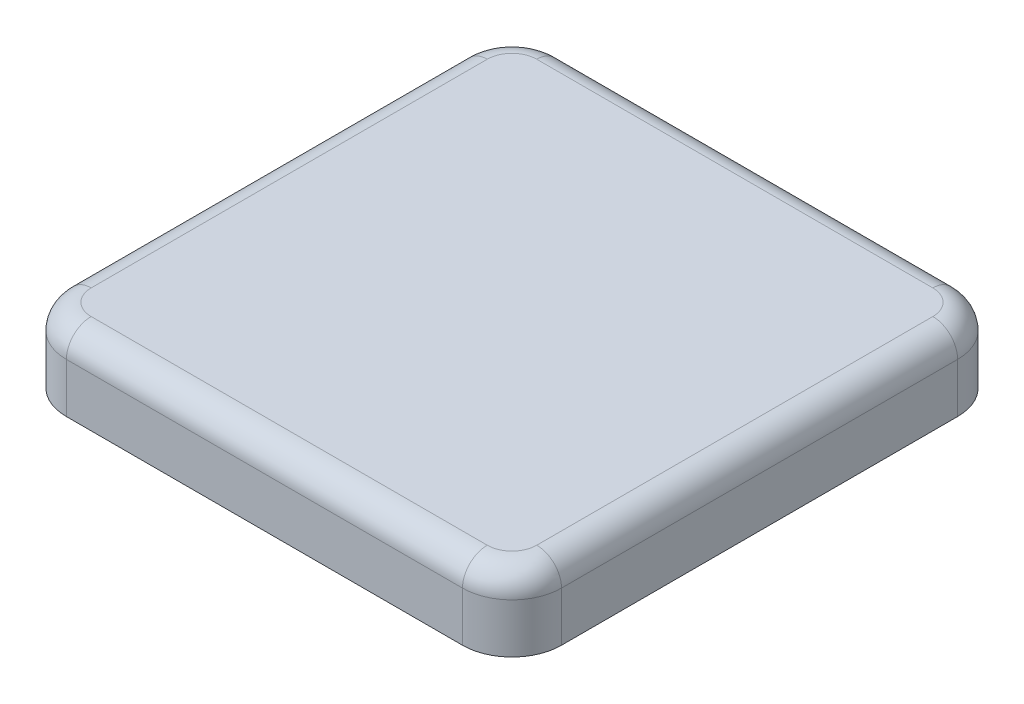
ISO-10303-21;
HEADER;
FILE_DESCRIPTION(('STEP AP214'),'2;1');
FILE_NAME('part.step','',(''),(''),'','','');
FILE_SCHEMA(('AUTOMOTIVE_DESIGN { 1 0 10303 214 1 1 1 1 }'));
ENDSEC;
DATA;
#1=APPLICATION_CONTEXT('core data for automotive mechanical design processes');
#2=APPLICATION_PROTOCOL_DEFINITION('international standard','automotive_design',2000,#1);
#3=PRODUCT_CONTEXT('',#1,'mechanical');
#4=PRODUCT('Part','Part','',(#3));
#5=PRODUCT_RELATED_PRODUCT_CATEGORY('part','',(#4));
#6=PRODUCT_DEFINITION_FORMATION('','',#4);
#7=PRODUCT_DEFINITION_CONTEXT('part definition',#1,'design');
#8=PRODUCT_DEFINITION('design','',#6,#7);
#9=PRODUCT_DEFINITION_SHAPE('','',#8);
#10=(LENGTH_UNIT() NAMED_UNIT(*) SI_UNIT(.MILLI.,.METRE.));
#11=(NAMED_UNIT(*) PLANE_ANGLE_UNIT() SI_UNIT($,.RADIAN.));
#12=(NAMED_UNIT(*) SI_UNIT($,.STERADIAN.) SOLID_ANGLE_UNIT());
#13=UNCERTAINTY_MEASURE_WITH_UNIT(LENGTH_MEASURE(1.E-05),#10,'distance_accuracy_value','');
#14=(GEOMETRIC_REPRESENTATION_CONTEXT(3) GLOBAL_UNCERTAINTY_ASSIGNED_CONTEXT((#13)) GLOBAL_UNIT_ASSIGNED_CONTEXT((#10,
#11,#12)) REPRESENTATION_CONTEXT('',''));
#15=CARTESIAN_POINT('',(0.,0.,0.));
#16=DIRECTION('',(0.,0.,1.));
#17=DIRECTION('',(1.,0.,0.));
#18=AXIS2_PLACEMENT_3D('',#15,#16,#17);
#19=CARTESIAN_POINT('',(-8.,-0.5,8.));
#20=DIRECTION('',(0.,-1.,0.));
#21=DIRECTION('',(0.,0.,-1.));
#22=AXIS2_PLACEMENT_3D('',#19,#20,#21);
#23=PLANE('',#22);
#24=DIRECTION('',(0.,0.,1.));
#25=VECTOR('',#24,1.);
#26=CARTESIAN_POINT('',(-7.8,-0.5,2.5));
#27=LINE('',#26,#25);
#28=CARTESIAN_POINT('',(-7.8,-0.5,-2.5));
#29=VERTEX_POINT('',#28);
#30=CARTESIAN_POINT('',(-7.8,-0.5,2.5));
#31=VERTEX_POINT('',#30);
#32=EDGE_CURVE('E282',#29,#31,#27,.T.);
#33=ORIENTED_EDGE('',*,*,#32,.F.);
#34=DIRECTION('',(1.,0.,0.));
#35=VECTOR('',#34,1.);
#36=CARTESIAN_POINT('',(-8.8,-0.5,-2.5));
#37=LINE('',#36,#35);
#38=CARTESIAN_POINT('',(-8.8,-0.5,-2.5));
#39=VERTEX_POINT('',#38);
#40=EDGE_CURVE('E247',#39,#29,#37,.T.);
#41=ORIENTED_EDGE('',*,*,#40,.F.);
#42=DIRECTION('',(0.,0.,-1.));
#43=VECTOR('',#42,1.);
#44=CARTESIAN_POINT('',(-8.8,-0.5,8.));
#45=LINE('',#44,#43);
#46=CARTESIAN_POINT('',(-8.8,-0.5,-8.));
#47=VERTEX_POINT('',#46);
#48=EDGE_CURVE('E304',#39,#47,#45,.T.);
#49=ORIENTED_EDGE('',*,*,#48,.T.);
#50=CARTESIAN_POINT('',(-8.,-0.5,-8.));
#51=DIRECTION('',(0.,-1.,0.));
#52=DIRECTION('',(0.,0.,-1.));
#53=AXIS2_PLACEMENT_3D('',#50,#51,#52);
#54=CIRCLE('',#53,0.800000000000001);
#55=CARTESIAN_POINT('',(-8.,-0.5,-8.8));
#56=VERTEX_POINT('',#55);
#57=EDGE_CURVE('E309',#47,#56,#54,.T.);
#58=ORIENTED_EDGE('',*,*,#57,.T.);
#59=DIRECTION('',(1.,0.,0.));
#60=VECTOR('',#59,1.);
#61=CARTESIAN_POINT('',(-8.,-0.5,-8.8));
#62=LINE('',#61,#60);
#63=CARTESIAN_POINT('',(8.,-0.5,-8.8));
#64=VERTEX_POINT('',#63);
#65=EDGE_CURVE('E312',#56,#64,#62,.T.);
#66=ORIENTED_EDGE('',*,*,#65,.T.);
#67=CARTESIAN_POINT('',(8.,-0.5,-8.));
#68=DIRECTION('',(0.,-1.,0.));
#69=DIRECTION('',(0.,0.,-1.));
#70=AXIS2_PLACEMENT_3D('',#67,#68,#69);
#71=CIRCLE('',#70,0.800000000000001);
#72=CARTESIAN_POINT('',(8.8,-0.5,-8.));
#73=VERTEX_POINT('',#72);
#74=EDGE_CURVE('E315',#64,#73,#71,.T.);
#75=ORIENTED_EDGE('',*,*,#74,.T.);
#76=DIRECTION('',(0.,0.,1.));
#77=VECTOR('',#76,1.);
#78=CARTESIAN_POINT('',(8.8,-0.5,8.));
#79=LINE('',#78,#77);
#80=CARTESIAN_POINT('',(8.8,-0.5,8.));
#81=VERTEX_POINT('',#80);
#82=EDGE_CURVE('E318',#73,#81,#79,.T.);
#83=ORIENTED_EDGE('',*,*,#82,.T.);
#84=CARTESIAN_POINT('',(8.,-0.5,8.));
#85=DIRECTION('',(0.,-1.,0.));
#86=DIRECTION('',(0.,0.,-1.));
#87=AXIS2_PLACEMENT_3D('',#84,#85,#86);
#88=CIRCLE('',#87,0.799999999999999);
#89=CARTESIAN_POINT('',(8.,-0.5,8.8));
#90=VERTEX_POINT('',#89);
#91=EDGE_CURVE('E321',#81,#90,#88,.T.);
#92=ORIENTED_EDGE('',*,*,#91,.T.);
#93=DIRECTION('',(-1.,0.,0.));
#94=VECTOR('',#93,1.);
#95=CARTESIAN_POINT('',(-8.,-0.5,8.8));
#96=LINE('',#95,#94);
#97=CARTESIAN_POINT('',(-8.,-0.5,8.8));
#98=VERTEX_POINT('',#97);
#99=EDGE_CURVE('E324',#90,#98,#96,.T.);
#100=ORIENTED_EDGE('',*,*,#99,.T.);
#101=CARTESIAN_POINT('',(-8.,-0.5,8.));
#102=DIRECTION('',(0.,-1.,0.));
#103=DIRECTION('',(0.,0.,-1.));
#104=AXIS2_PLACEMENT_3D('',#101,#102,#103);
#105=CIRCLE('',#104,0.8);
#106=CARTESIAN_POINT('',(-8.8,-0.5,8.));
#107=VERTEX_POINT('',#106);
#108=EDGE_CURVE('E301',#98,#107,#105,.T.);
#109=ORIENTED_EDGE('',*,*,#108,.T.);
#110=CARTESIAN_POINT('',(-8.8,-0.5,2.5));
#111=VERTEX_POINT('',#110);
#112=EDGE_CURVE('E306',#107,#111,#45,.T.);
#113=ORIENTED_EDGE('',*,*,#112,.T.);
#114=DIRECTION('',(-1.,0.,0.));
#115=VECTOR('',#114,1.);
#116=CARTESIAN_POINT('',(-8.8,-0.5,2.5));
#117=LINE('',#116,#115);
#118=EDGE_CURVE('E274',#31,#111,#117,.T.);
#119=ORIENTED_EDGE('',*,*,#118,.F.);
#120=EDGE_LOOP('',(#33,#41,#49,#58,#66,#75,#83,#92,#100,#109,#113,#119));
#121=FACE_BOUND('',#120,.T.);
#122=DIRECTION('',(1.,0.,0.));
#123=VECTOR('',#122,1.);
#124=CARTESIAN_POINT('',(-1.2,-0.5,-2.1));
#125=LINE('',#124,#123);
#126=CARTESIAN_POINT('',(-1.2,-0.5,-2.1));
#127=VERTEX_POINT('',#126);
#128=CARTESIAN_POINT('',(1.2,-0.5,-2.1));
#129=VERTEX_POINT('',#128);
#130=EDGE_CURVE('E243',#127,#129,#125,.T.);
#131=ORIENTED_EDGE('',*,*,#130,.F.);
#132=DIRECTION('',(0.,0.,-1.));
#133=VECTOR('',#132,1.);
#134=CARTESIAN_POINT('',(-1.2,-0.5,2.1));
#135=LINE('',#134,#133);
#136=CARTESIAN_POINT('',(-1.2,-0.5,2.1));
#137=VERTEX_POINT('',#136);
#138=EDGE_CURVE('E251',#137,#127,#135,.T.);
#139=ORIENTED_EDGE('',*,*,#138,.F.);
#140=DIRECTION('',(-1.,0.,0.));
#141=VECTOR('',#140,1.);
#142=CARTESIAN_POINT('',(-1.2,-0.5,2.1));
#143=LINE('',#142,#141);
#144=CARTESIAN_POINT('',(1.2,-0.5,2.1));
#145=VERTEX_POINT('',#144);
#146=EDGE_CURVE('E262',#145,#137,#143,.T.);
#147=ORIENTED_EDGE('',*,*,#146,.F.);
#148=DIRECTION('',(0.,0.,1.));
#149=VECTOR('',#148,1.);
#150=CARTESIAN_POINT('',(1.2,-0.5,2.1));
#151=LINE('',#150,#149);
#152=EDGE_CURVE('E260',#129,#145,#151,.T.);
#153=ORIENTED_EDGE('',*,*,#152,.F.);
#154=EDGE_LOOP('',(#131,#139,#147,#153));
#155=FACE_BOUND('',#154,.T.);
#156=ADVANCED_FACE('F37',(#121,#155),#23,.T.);
#157=CARTESIAN_POINT('',(-8.8,-0.5,8.));
#158=DIRECTION('',(-1.,0.,0.));
#159=DIRECTION('',(0.,0.,1.));
#160=AXIS2_PLACEMENT_3D('',#157,#158,#159);
#161=PLANE('',#160);
#162=DIRECTION('',(0.,1.,0.));
#163=VECTOR('',#162,1.);
#164=CARTESIAN_POINT('',(-8.8,-2.5,-2.5));
#165=LINE('',#164,#163);
#166=CARTESIAN_POINT('',(-8.8,-1.5,-2.5));
#167=VERTEX_POINT('',#166);
#168=EDGE_CURVE('E294',#167,#39,#165,.T.);
#169=ORIENTED_EDGE('',*,*,#168,.F.);
#170=DIRECTION('',(0.,0.,-1.));
#171=VECTOR('',#170,1.);
#172=CARTESIAN_POINT('',(-8.8,-1.5,8.));
#173=LINE('',#172,#171);
#174=CARTESIAN_POINT('',(-8.8,-1.5,-8.));
#175=VERTEX_POINT('',#174);
#176=EDGE_CURVE('E329',#167,#175,#173,.T.);
#177=ORIENTED_EDGE('',*,*,#176,.T.);
#178=DIRECTION('',(0.,-1.,0.));
#179=VECTOR('',#178,1.);
#180=CARTESIAN_POINT('',(-8.8,-0.5,-8.));
#181=LINE('',#180,#179);
#182=EDGE_CURVE('E363',#47,#175,#181,.T.);
#183=ORIENTED_EDGE('',*,*,#182,.F.);
#184=ORIENTED_EDGE('',*,*,#48,.F.);
#185=EDGE_LOOP('',(#169,#177,#183,#184));
#186=FACE_BOUND('',#185,.T.);
#187=ADVANCED_FACE('F512',(#186),#161,.F.);
#188=DIRECTION('',(0.,1.,0.));
#189=VECTOR('',#188,1.);
#190=CARTESIAN_POINT('',(-8.8,-2.5,2.5));
#191=LINE('',#190,#189);
#192=CARTESIAN_POINT('',(-8.8,-1.5,2.5));
#193=VERTEX_POINT('',#192);
#194=EDGE_CURVE('E280',#193,#111,#191,.T.);
#195=ORIENTED_EDGE('',*,*,#194,.T.);
#196=ORIENTED_EDGE('',*,*,#112,.F.);
#197=DIRECTION('',(0.,-1.,0.));
#198=VECTOR('',#197,1.);
#199=CARTESIAN_POINT('',(-8.8,-0.5,8.));
#200=LINE('',#199,#198);
#201=CARTESIAN_POINT('',(-8.8,-1.5,8.));
#202=VERTEX_POINT('',#201);
#203=EDGE_CURVE('E327',#107,#202,#200,.T.);
#204=ORIENTED_EDGE('',*,*,#203,.T.);
#205=EDGE_CURVE('E330',#202,#193,#173,.T.);
#206=ORIENTED_EDGE('',*,*,#205,.T.);
#207=EDGE_LOOP('',(#195,#196,#204,#206));
#208=FACE_BOUND('',#207,.T.);
#209=ADVANCED_FACE('F518',(#208),#161,.F.);
#210=CARTESIAN_POINT('',(-8.,1.5,-8.00000000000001));
#211=DIRECTION('',(0.,-1.,0.));
#212=DIRECTION('',(0.,0.,-1.));
#213=AXIS2_PLACEMENT_3D('',#210,#211,#212);
#214=CYLINDRICAL_SURFACE('',#213,2.);
#215=DIRECTION('',(0.,-1.,0.));
#216=VECTOR('',#215,1.);
#217=CARTESIAN_POINT('',(-10.,1.5,-8.00000000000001));
#218=LINE('',#217,#216);
#219=CARTESIAN_POINT('',(-10.,0.5,-8.00000000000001));
#220=VERTEX_POINT('',#219);
#221=CARTESIAN_POINT('',(-10.,-1.5,-8.00000000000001));
#222=VERTEX_POINT('',#221);
#223=EDGE_CURVE('E407',#220,#222,#218,.T.);
#224=ORIENTED_EDGE('',*,*,#223,.F.);
#225=CARTESIAN_POINT('',(-8.,0.5,-8.00000000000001));
#226=DIRECTION('',(0.,1.,0.));
#227=DIRECTION('',(0.,0.,1.));
#228=AXIS2_PLACEMENT_3D('',#225,#226,#227);
#229=CIRCLE('',#228,2.);
#230=CARTESIAN_POINT('',(-8.,0.5,-10.));
#231=VERTEX_POINT('',#230);
#232=EDGE_CURVE('E431',#220,#231,#229,.F.);
#233=ORIENTED_EDGE('',*,*,#232,.T.);
#234=DIRECTION('',(0.,-1.,0.));
#235=VECTOR('',#234,1.);
#236=CARTESIAN_POINT('',(-8.,1.5,-10.));
#237=LINE('',#236,#235);
#238=CARTESIAN_POINT('',(-8.,-1.5,-10.));
#239=VERTEX_POINT('',#238);
#240=EDGE_CURVE('E393',#231,#239,#237,.T.);
#241=ORIENTED_EDGE('',*,*,#240,.T.);
#242=CARTESIAN_POINT('',(-8.,-1.5,-8.00000000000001));
#243=DIRECTION('',(0.,1.,0.));
#244=DIRECTION('',(0.,0.,1.));
#245=AXIS2_PLACEMENT_3D('',#242,#243,#244);
#246=CIRCLE('',#245,2.);
#247=EDGE_CURVE('E368',#239,#222,#246,.T.);
#248=ORIENTED_EDGE('',*,*,#247,.T.);
#249=EDGE_LOOP('',(#224,#233,#241,#248));
#250=FACE_BOUND('',#249,.T.);
#251=ADVANCED_FACE('F591',(#250),#214,.T.);
#252=CARTESIAN_POINT('',(-10.,1.5,8.));
#253=DIRECTION('',(1.,0.,0.));
#254=DIRECTION('',(0.,0.,-1.));
#255=AXIS2_PLACEMENT_3D('',#252,#253,#254);
#256=PLANE('',#255);
#257=DIRECTION('',(0.,-1.,0.));
#258=VECTOR('',#257,1.);
#259=CARTESIAN_POINT('',(-10.,1.5,8.));
#260=LINE('',#259,#258);
#261=CARTESIAN_POINT('',(-10.,0.5,8.));
#262=VERTEX_POINT('',#261);
#263=CARTESIAN_POINT('',(-10.,-1.5,8.));
#264=VERTEX_POINT('',#263);
#265=EDGE_CURVE('E405',#262,#264,#260,.T.);
#266=ORIENTED_EDGE('',*,*,#265,.F.);
#267=DIRECTION('',(0.,0.,1.));
#268=VECTOR('',#267,1.);
#269=CARTESIAN_POINT('',(-10.,0.5,-8.00000000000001));
#270=LINE('',#269,#268);
#271=EDGE_CURVE('E429',#262,#220,#270,.F.);
#272=ORIENTED_EDGE('',*,*,#271,.T.);
#273=ORIENTED_EDGE('',*,*,#223,.T.);
#274=DIRECTION('',(0.,0.,1.));
#275=VECTOR('',#274,1.);
#276=CARTESIAN_POINT('',(-10.,-1.5,8.));
#277=LINE('',#276,#275);
#278=EDGE_CURVE('E371',#222,#264,#277,.T.);
#279=ORIENTED_EDGE('',*,*,#278,.T.);
#280=EDGE_LOOP('',(#266,#272,#273,#279));
#281=FACE_BOUND('',#280,.T.);
#282=ADVANCED_FACE('F587',(#281),#256,.F.);
#283=CARTESIAN_POINT('',(-8.,1.5,8.));
#284=DIRECTION('',(0.,-1.,0.));
#285=DIRECTION('',(0.,0.,-1.));
#286=AXIS2_PLACEMENT_3D('',#283,#284,#285);
#287=CYLINDRICAL_SURFACE('',#286,2.);
#288=DIRECTION('',(0.,-1.,0.));
#289=VECTOR('',#288,1.);
#290=CARTESIAN_POINT('',(-8.,1.5,10.));
#291=LINE('',#290,#289);
#292=CARTESIAN_POINT('',(-8.,0.5,10.));
#293=VERTEX_POINT('',#292);
#294=CARTESIAN_POINT('',(-8.,-1.5,10.));
#295=VERTEX_POINT('',#294);
#296=EDGE_CURVE('E403',#293,#295,#291,.T.);
#297=ORIENTED_EDGE('',*,*,#296,.F.);
#298=CARTESIAN_POINT('',(-8.,0.5,8.));
#299=DIRECTION('',(0.,1.,0.));
#300=DIRECTION('',(0.,0.,1.));
#301=AXIS2_PLACEMENT_3D('',#298,#299,#300);
#302=CIRCLE('',#301,2.);
#303=EDGE_CURVE('E426',#293,#262,#302,.F.);
#304=ORIENTED_EDGE('',*,*,#303,.T.);
#305=ORIENTED_EDGE('',*,*,#265,.T.);
#306=CARTESIAN_POINT('',(-8.,-1.5,8.));
#307=DIRECTION('',(0.,1.,0.));
#308=DIRECTION('',(0.,0.,1.));
#309=AXIS2_PLACEMENT_3D('',#306,#307,#308);
#310=CIRCLE('',#309,2.);
#311=EDGE_CURVE('E375',#264,#295,#310,.T.);
#312=ORIENTED_EDGE('',*,*,#311,.T.);
#313=EDGE_LOOP('',(#297,#304,#305,#312));
#314=FACE_BOUND('',#313,.T.);
#315=ADVANCED_FACE('F583',(#314),#287,.T.);
#316=CARTESIAN_POINT('',(-8.,1.5,10.));
#317=DIRECTION('',(0.,0.,-1.));
#318=DIRECTION('',(-1.,0.,0.));
#319=AXIS2_PLACEMENT_3D('',#316,#317,#318);
#320=PLANE('',#319);
#321=DIRECTION('',(0.,-1.,0.));
#322=VECTOR('',#321,1.);
#323=CARTESIAN_POINT('',(8.,1.5,10.));
#324=LINE('',#323,#322);
#325=CARTESIAN_POINT('',(8.,0.5,10.));
#326=VERTEX_POINT('',#325);
#327=CARTESIAN_POINT('',(8.,-1.5,10.));
#328=VERTEX_POINT('',#327);
#329=EDGE_CURVE('E401',#326,#328,#324,.T.);
#330=ORIENTED_EDGE('',*,*,#329,.F.);
#331=DIRECTION('',(1.,0.,0.));
#332=VECTOR('',#331,1.);
#333=CARTESIAN_POINT('',(-8.,0.5,10.));
#334=LINE('',#333,#332);
#335=EDGE_CURVE('E441',#326,#293,#334,.F.);
#336=ORIENTED_EDGE('',*,*,#335,.T.);
#337=ORIENTED_EDGE('',*,*,#296,.T.);
#338=DIRECTION('',(1.,0.,0.));
#339=VECTOR('',#338,1.);
#340=CARTESIAN_POINT('',(-8.,-1.5,10.));
#341=LINE('',#340,#339);
#342=EDGE_CURVE('E378',#295,#328,#341,.T.);
#343=ORIENTED_EDGE('',*,*,#342,.T.);
#344=EDGE_LOOP('',(#330,#336,#337,#343));
#345=FACE_BOUND('',#344,.T.);
#346=ADVANCED_FACE('F579',(#345),#320,.F.);
#347=CARTESIAN_POINT('',(8.,1.5,8.));
#348=DIRECTION('',(0.,-1.,0.));
#349=DIRECTION('',(0.,0.,-1.));
#350=AXIS2_PLACEMENT_3D('',#347,#348,#349);
#351=CYLINDRICAL_SURFACE('',#350,2.);
#352=DIRECTION('',(0.,-1.,0.));
#353=VECTOR('',#352,1.);
#354=CARTESIAN_POINT('',(10.,1.5,8.));
#355=LINE('',#354,#353);
#356=CARTESIAN_POINT('',(10.,0.5,8.));
#357=VERTEX_POINT('',#356);
#358=CARTESIAN_POINT('',(10.,-1.5,8.));
#359=VERTEX_POINT('',#358);
#360=EDGE_CURVE('E399',#357,#359,#355,.T.);
#361=ORIENTED_EDGE('',*,*,#360,.F.);
#362=CARTESIAN_POINT('',(8.,0.5,8.));
#363=DIRECTION('',(0.,1.,0.));
#364=DIRECTION('',(0.,0.,1.));
#365=AXIS2_PLACEMENT_3D('',#362,#363,#364);
#366=CIRCLE('',#365,2.);
#367=EDGE_CURVE('E439',#357,#326,#366,.F.);
#368=ORIENTED_EDGE('',*,*,#367,.T.);
#369=ORIENTED_EDGE('',*,*,#329,.T.);
#370=CARTESIAN_POINT('',(8.,-1.5,8.));
#371=DIRECTION('',(0.,1.,0.));
#372=DIRECTION('',(0.,0.,1.));
#373=AXIS2_PLACEMENT_3D('',#370,#371,#372);
#374=CIRCLE('',#373,2.);
#375=EDGE_CURVE('E381',#328,#359,#374,.T.);
#376=ORIENTED_EDGE('',*,*,#375,.T.);
#377=EDGE_LOOP('',(#361,#368,#369,#376));
#378=FACE_BOUND('',#377,.T.);
#379=ADVANCED_FACE('F575',(#378),#351,.T.);
#380=CARTESIAN_POINT('',(10.,1.5,8.));
#381=DIRECTION('',(-1.,0.,0.));
#382=DIRECTION('',(0.,0.,1.));
#383=AXIS2_PLACEMENT_3D('',#380,#381,#382);
#384=PLANE('',#383);
#385=DIRECTION('',(0.,-1.,0.));
#386=VECTOR('',#385,1.);
#387=CARTESIAN_POINT('',(10.,1.5,-8.00000000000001));
#388=LINE('',#387,#386);
#389=CARTESIAN_POINT('',(10.,0.5,-8.00000000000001));
#390=VERTEX_POINT('',#389);
#391=CARTESIAN_POINT('',(10.,-1.5,-8.00000000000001));
#392=VERTEX_POINT('',#391);
#393=EDGE_CURVE('E397',#390,#392,#388,.T.);
#394=ORIENTED_EDGE('',*,*,#393,.F.);
#395=DIRECTION('',(0.,0.,-1.));
#396=VECTOR('',#395,1.);
#397=CARTESIAN_POINT('',(10.,0.5,8.));
#398=LINE('',#397,#396);
#399=EDGE_CURVE('E437',#390,#357,#398,.F.);
#400=ORIENTED_EDGE('',*,*,#399,.T.);
#401=ORIENTED_EDGE('',*,*,#360,.T.);
#402=DIRECTION('',(0.,0.,-1.));
#403=VECTOR('',#402,1.);
#404=CARTESIAN_POINT('',(10.,-1.5,8.));
#405=LINE('',#404,#403);
#406=EDGE_CURVE('E384',#359,#392,#405,.T.);
#407=ORIENTED_EDGE('',*,*,#406,.T.);
#408=EDGE_LOOP('',(#394,#400,#401,#407));
#409=FACE_BOUND('',#408,.T.);
#410=ADVANCED_FACE('F571',(#409),#384,.F.);
#411=CARTESIAN_POINT('',(8.,1.5,-8.00000000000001));
#412=DIRECTION('',(0.,-1.,0.));
#413=DIRECTION('',(0.,0.,-1.));
#414=AXIS2_PLACEMENT_3D('',#411,#412,#413);
#415=CYLINDRICAL_SURFACE('',#414,2.);
#416=DIRECTION('',(0.,-1.,0.));
#417=VECTOR('',#416,1.);
#418=CARTESIAN_POINT('',(8.,1.5,-10.));
#419=LINE('',#418,#417);
#420=CARTESIAN_POINT('',(8.,0.5,-10.));
#421=VERTEX_POINT('',#420);
#422=CARTESIAN_POINT('',(8.,-1.5,-10.));
#423=VERTEX_POINT('',#422);
#424=EDGE_CURVE('E395',#421,#423,#419,.T.);
#425=ORIENTED_EDGE('',*,*,#424,.F.);
#426=CARTESIAN_POINT('',(8.,0.5,-8.00000000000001));
#427=DIRECTION('',(0.,1.,0.));
#428=DIRECTION('',(0.,0.,1.));
#429=AXIS2_PLACEMENT_3D('',#426,#427,#428);
#430=CIRCLE('',#429,2.);
#431=EDGE_CURVE('E435',#421,#390,#430,.F.);
#432=ORIENTED_EDGE('',*,*,#431,.T.);
#433=ORIENTED_EDGE('',*,*,#393,.T.);
#434=CARTESIAN_POINT('',(8.,-1.5,-8.00000000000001));
#435=DIRECTION('',(0.,1.,0.));
#436=DIRECTION('',(0.,0.,1.));
#437=AXIS2_PLACEMENT_3D('',#434,#435,#436);
#438=CIRCLE('',#437,2.);
#439=EDGE_CURVE('E387',#392,#423,#438,.T.);
#440=ORIENTED_EDGE('',*,*,#439,.T.);
#441=EDGE_LOOP('',(#425,#432,#433,#440));
#442=FACE_BOUND('',#441,.T.);
#443=ADVANCED_FACE('F567',(#442),#415,.T.);
#444=CARTESIAN_POINT('',(-8.,1.5,-10.));
#445=DIRECTION('',(0.,0.,1.));
#446=DIRECTION('',(1.,0.,0.));
#447=AXIS2_PLACEMENT_3D('',#444,#445,#446);
#448=PLANE('',#447);
#449=ORIENTED_EDGE('',*,*,#240,.F.);
#450=DIRECTION('',(-1.,0.,0.));
#451=VECTOR('',#450,1.);
#452=CARTESIAN_POINT('',(8.,0.5,-10.));
#453=LINE('',#452,#451);
#454=EDGE_CURVE('E433',#231,#421,#453,.F.);
#455=ORIENTED_EDGE('',*,*,#454,.T.);
#456=ORIENTED_EDGE('',*,*,#424,.T.);
#457=DIRECTION('',(-1.,0.,0.));
#458=VECTOR('',#457,1.);
#459=CARTESIAN_POINT('',(-8.,-1.5,-10.));
#460=LINE('',#459,#458);
#461=EDGE_CURVE('E390',#423,#239,#460,.T.);
#462=ORIENTED_EDGE('',*,*,#461,.T.);
#463=EDGE_LOOP('',(#449,#455,#456,#462));
#464=FACE_BOUND('',#463,.T.);
#465=ADVANCED_FACE('F559',(#464),#448,.F.);
#466=CARTESIAN_POINT('',(-8.,1.5,-8.00000000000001));
#467=DIRECTION('',(0.,1.,0.));
#468=DIRECTION('',(0.,0.,1.));
#469=AXIS2_PLACEMENT_3D('',#466,#467,#468);
#470=PLANE('',#469);
#471=DIRECTION('',(0.,0.,1.));
#472=VECTOR('',#471,1.);
#473=CARTESIAN_POINT('',(-9.,1.5,8.));
#474=LINE('',#473,#472);
#475=CARTESIAN_POINT('',(-9.,1.5,-8.00000000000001));
#476=VERTEX_POINT('',#475);
#477=CARTESIAN_POINT('',(-9.,1.5,8.));
#478=VERTEX_POINT('',#477);
#479=EDGE_CURVE('E421',#476,#478,#474,.T.);
#480=ORIENTED_EDGE('',*,*,#479,.T.);
#481=CARTESIAN_POINT('',(-8.,1.5,8.));
#482=DIRECTION('',(0.,1.,0.));
#483=DIRECTION('',(0.,0.,1.));
#484=AXIS2_PLACEMENT_3D('',#481,#482,#483);
#485=CIRCLE('',#484,1.);
#486=CARTESIAN_POINT('',(-8.,1.5,9.));
#487=VERTEX_POINT('',#486);
#488=EDGE_CURVE('E423',#478,#487,#485,.T.);
#489=ORIENTED_EDGE('',*,*,#488,.T.);
#490=DIRECTION('',(1.,0.,0.));
#491=VECTOR('',#490,1.);
#492=CARTESIAN_POINT('',(8.,1.5,9.));
#493=LINE('',#492,#491);
#494=CARTESIAN_POINT('',(8.,1.5,9.));
#495=VERTEX_POINT('',#494);
#496=EDGE_CURVE('E409',#487,#495,#493,.T.);
#497=ORIENTED_EDGE('',*,*,#496,.T.);
#498=CARTESIAN_POINT('',(8.,1.5,8.));
#499=DIRECTION('',(0.,1.,0.));
#500=DIRECTION('',(0.,0.,1.));
#501=AXIS2_PLACEMENT_3D('',#498,#499,#500);
#502=CIRCLE('',#501,0.999999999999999);
#503=CARTESIAN_POINT('',(9.,1.5,8.));
#504=VERTEX_POINT('',#503);
#505=EDGE_CURVE('E411',#495,#504,#502,.T.);
#506=ORIENTED_EDGE('',*,*,#505,.T.);
#507=DIRECTION('',(0.,0.,-1.));
#508=VECTOR('',#507,1.);
#509=CARTESIAN_POINT('',(9.,1.5,-8.00000000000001));
#510=LINE('',#509,#508);
#511=CARTESIAN_POINT('',(9.,1.5,-8.00000000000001));
#512=VERTEX_POINT('',#511);
#513=EDGE_CURVE('E413',#504,#512,#510,.T.);
#514=ORIENTED_EDGE('',*,*,#513,.T.);
#515=CARTESIAN_POINT('',(8.,1.5,-8.00000000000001));
#516=DIRECTION('',(0.,1.,0.));
#517=DIRECTION('',(0.,0.,1.));
#518=AXIS2_PLACEMENT_3D('',#515,#516,#517);
#519=CIRCLE('',#518,0.999999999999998);
#520=CARTESIAN_POINT('',(8.,1.5,-9.00000000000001));
#521=VERTEX_POINT('',#520);
#522=EDGE_CURVE('E415',#512,#521,#519,.T.);
#523=ORIENTED_EDGE('',*,*,#522,.T.);
#524=DIRECTION('',(-1.,0.,0.));
#525=VECTOR('',#524,1.);
#526=CARTESIAN_POINT('',(-8.,1.5,-9.00000000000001));
#527=LINE('',#526,#525);
#528=CARTESIAN_POINT('',(-8.,1.5,-9.00000000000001));
#529=VERTEX_POINT('',#528);
#530=EDGE_CURVE('E417',#521,#529,#527,.T.);
#531=ORIENTED_EDGE('',*,*,#530,.T.);
#532=CARTESIAN_POINT('',(-8.,1.5,-8.00000000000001));
#533=DIRECTION('',(0.,1.,0.));
#534=DIRECTION('',(0.,0.,1.));
#535=AXIS2_PLACEMENT_3D('',#532,#533,#534);
#536=CIRCLE('',#535,0.999999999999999);
#537=EDGE_CURVE('E419',#529,#476,#536,.T.);
#538=ORIENTED_EDGE('',*,*,#537,.T.);
#539=EDGE_LOOP('',(#480,#489,#497,#506,#514,#523,#531,#538));
#540=FACE_BOUND('',#539,.T.);
#541=ADVANCED_FACE('F555',(#540),#470,.T.);
#542=CARTESIAN_POINT('',(-8.,-1.5,-8.00000000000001));
#543=DIRECTION('',(0.,1.,0.));
#544=DIRECTION('',(0.,0.,1.));
#545=AXIS2_PLACEMENT_3D('',#542,#543,#544);
#546=PLANE('',#545);
#547=ORIENTED_EDGE('',*,*,#205,.F.);
#548=CARTESIAN_POINT('',(-8.,-1.5,8.));
#549=DIRECTION('',(0.,-1.,0.));
#550=DIRECTION('',(0.,0.,-1.));
#551=AXIS2_PLACEMENT_3D('',#548,#549,#550);
#552=CIRCLE('',#551,0.8);
#553=CARTESIAN_POINT('',(-8.,-1.5,8.8));
#554=VERTEX_POINT('',#553);
#555=EDGE_CURVE('E300',#554,#202,#552,.T.);
#556=ORIENTED_EDGE('',*,*,#555,.F.);
#557=DIRECTION('',(-1.,0.,0.));
#558=VECTOR('',#557,1.);
#559=CARTESIAN_POINT('',(-8.,-1.5,8.8));
#560=LINE('',#559,#558);
#561=CARTESIAN_POINT('',(8.,-1.5,8.8));
#562=VERTEX_POINT('',#561);
#563=EDGE_CURVE('E305',#562,#554,#560,.T.);
#564=ORIENTED_EDGE('',*,*,#563,.F.);
#565=CARTESIAN_POINT('',(8.,-1.5,8.));
#566=DIRECTION('',(0.,-1.,0.));
#567=DIRECTION('',(0.,0.,-1.));
#568=AXIS2_PLACEMENT_3D('',#565,#566,#567);
#569=CIRCLE('',#568,0.799999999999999);
#570=CARTESIAN_POINT('',(8.8,-1.5,8.));
#571=VERTEX_POINT('',#570);
#572=EDGE_CURVE('E345',#571,#562,#569,.T.);
#573=ORIENTED_EDGE('',*,*,#572,.F.);
#574=DIRECTION('',(0.,0.,1.));
#575=VECTOR('',#574,1.);
#576=CARTESIAN_POINT('',(8.8,-1.5,8.));
#577=LINE('',#576,#575);
#578=CARTESIAN_POINT('',(8.8,-1.5,-8.));
#579=VERTEX_POINT('',#578);
#580=EDGE_CURVE('E342',#579,#571,#577,.T.);
#581=ORIENTED_EDGE('',*,*,#580,.F.);
#582=CARTESIAN_POINT('',(8.,-1.5,-8.));
#583=DIRECTION('',(0.,-1.,0.));
#584=DIRECTION('',(0.,0.,-1.));
#585=AXIS2_PLACEMENT_3D('',#582,#583,#584);
#586=CIRCLE('',#585,0.800000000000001);
#587=CARTESIAN_POINT('',(8.,-1.5,-8.8));
#588=VERTEX_POINT('',#587);
#589=EDGE_CURVE('E339',#588,#579,#586,.T.);
#590=ORIENTED_EDGE('',*,*,#589,.F.);
#591=DIRECTION('',(1.,0.,0.));
#592=VECTOR('',#591,1.);
#593=CARTESIAN_POINT('',(-8.,-1.5,-8.8));
#594=LINE('',#593,#592);
#595=CARTESIAN_POINT('',(-8.,-1.5,-8.8));
#596=VERTEX_POINT('',#595);
#597=EDGE_CURVE('E336',#596,#588,#594,.T.);
#598=ORIENTED_EDGE('',*,*,#597,.F.);
#599=CARTESIAN_POINT('',(-8.,-1.5,-8.));
#600=DIRECTION('',(0.,-1.,0.));
#601=DIRECTION('',(0.,0.,-1.));
#602=AXIS2_PLACEMENT_3D('',#599,#600,#601);
#603=CIRCLE('',#602,0.800000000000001);
#604=EDGE_CURVE('E333',#175,#596,#603,.T.);
#605=ORIENTED_EDGE('',*,*,#604,.F.);
#606=ORIENTED_EDGE('',*,*,#176,.F.);
#607=DIRECTION('',(0.,0.,-1.));
#608=VECTOR('',#607,1.);
#609=CARTESIAN_POINT('',(-8.8,-1.5,-8.00000000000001));
#610=LINE('',#609,#608);
#611=EDGE_CURVE('E298',#193,#167,#610,.T.);
#612=ORIENTED_EDGE('',*,*,#611,.F.);
#613=EDGE_LOOP('',(#547,#556,#564,#573,#581,#590,#598,#605,#606,#612));
#614=FACE_BOUND('',#613,.T.);
#615=ORIENTED_EDGE('',*,*,#247,.F.);
#616=ORIENTED_EDGE('',*,*,#461,.F.);
#617=ORIENTED_EDGE('',*,*,#439,.F.);
#618=ORIENTED_EDGE('',*,*,#406,.F.);
#619=ORIENTED_EDGE('',*,*,#375,.F.);
#620=ORIENTED_EDGE('',*,*,#342,.F.);
#621=ORIENTED_EDGE('',*,*,#311,.F.);
#622=ORIENTED_EDGE('',*,*,#278,.F.);
#623=EDGE_LOOP('',(#615,#616,#617,#618,#619,#620,#621,#622));
#624=FACE_BOUND('',#623,.T.);
#625=ADVANCED_FACE('F558',(#614,#624),#546,.F.);
#626=CARTESIAN_POINT('',(8.,0.5,-8.00000000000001));
#627=DIRECTION('',(0.,1.,0.));
#628=DIRECTION('',(0.,0.,1.));
#629=AXIS2_PLACEMENT_3D('',#626,#627,#628);
#630=DEGENERATE_TOROIDAL_SURFACE('',#629,0.999999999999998,1.,.T.);
#631=CARTESIAN_POINT('',(9.,0.5,-8.00000000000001));
#632=DIRECTION('',(0.,0.,1.));
#633=DIRECTION('',(1.,0.,0.));
#634=AXIS2_PLACEMENT_3D('',#631,#632,#633);
#635=CIRCLE('',#634,1.);
#636=EDGE_CURVE('E459',#390,#512,#635,.T.);
#637=ORIENTED_EDGE('',*,*,#636,.F.);
#638=ORIENTED_EDGE('',*,*,#431,.F.);
#639=CARTESIAN_POINT('',(8.,0.5,-9.00000000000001));
#640=DIRECTION('',(-1.,0.,0.));
#641=DIRECTION('',(0.,0.,1.));
#642=AXIS2_PLACEMENT_3D('',#639,#640,#641);
#643=CIRCLE('',#642,1.);
#644=EDGE_CURVE('E372',#521,#421,#643,.T.);
#645=ORIENTED_EDGE('',*,*,#644,.F.);
#646=ORIENTED_EDGE('',*,*,#522,.F.);
#647=EDGE_LOOP('',(#637,#638,#645,#646));
#648=FACE_BOUND('',#647,.T.);
#649=ADVANCED_FACE('F563',(#648),#630,.T.);
#650=CARTESIAN_POINT('',(-8.,0.5,-9.00000000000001));
#651=DIRECTION('',(1.,0.,0.));
#652=DIRECTION('',(0.,0.,-1.));
#653=AXIS2_PLACEMENT_3D('',#650,#651,#652);
#654=CYLINDRICAL_SURFACE('',#653,1.);
#655=ORIENTED_EDGE('',*,*,#644,.T.);
#656=ORIENTED_EDGE('',*,*,#454,.F.);
#657=CARTESIAN_POINT('',(-8.,0.5,-9.00000000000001));
#658=DIRECTION('',(-1.,0.,0.));
#659=DIRECTION('',(0.,0.,1.));
#660=AXIS2_PLACEMENT_3D('',#657,#658,#659);
#661=CIRCLE('',#660,1.);
#662=EDGE_CURVE('E456',#529,#231,#661,.T.);
#663=ORIENTED_EDGE('',*,*,#662,.F.);
#664=ORIENTED_EDGE('',*,*,#530,.F.);
#665=EDGE_LOOP('',(#655,#656,#663,#664));
#666=FACE_BOUND('',#665,.T.);
#667=ADVANCED_FACE('F618',(#666),#654,.T.);
#668=CARTESIAN_POINT('',(9.,0.5,-8.));
#669=DIRECTION('',(0.,0.,1.));
#670=DIRECTION('',(1.,0.,0.));
#671=AXIS2_PLACEMENT_3D('',#668,#669,#670);
#672=CYLINDRICAL_SURFACE('',#671,1.);
#673=ORIENTED_EDGE('',*,*,#636,.T.);
#674=ORIENTED_EDGE('',*,*,#513,.F.);
#675=CARTESIAN_POINT('',(9.,0.5,8.));
#676=DIRECTION('',(0.,0.,1.));
#677=DIRECTION('',(1.,0.,0.));
#678=AXIS2_PLACEMENT_3D('',#675,#676,#677);
#679=CIRCLE('',#678,1.);
#680=EDGE_CURVE('E453',#357,#504,#679,.T.);
#681=ORIENTED_EDGE('',*,*,#680,.F.);
#682=ORIENTED_EDGE('',*,*,#399,.F.);
#683=EDGE_LOOP('',(#673,#674,#681,#682));
#684=FACE_BOUND('',#683,.T.);
#685=ADVANCED_FACE('F614',(#684),#672,.T.);
#686=CARTESIAN_POINT('',(-8.,0.5,-8.00000000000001));
#687=DIRECTION('',(0.,1.,0.));
#688=DIRECTION('',(0.,0.,1.));
#689=AXIS2_PLACEMENT_3D('',#686,#687,#688);
#690=DEGENERATE_TOROIDAL_SURFACE('',#689,0.999999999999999,1.,.T.);
#691=ORIENTED_EDGE('',*,*,#662,.T.);
#692=ORIENTED_EDGE('',*,*,#232,.F.);
#693=CARTESIAN_POINT('',(-9.,0.5,-8.00000000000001));
#694=DIRECTION('',(0.,0.,1.));
#695=DIRECTION('',(1.,0.,0.));
#696=AXIS2_PLACEMENT_3D('',#693,#694,#695);
#697=CIRCLE('',#696,1.);
#698=EDGE_CURVE('E450',#476,#220,#697,.T.);
#699=ORIENTED_EDGE('',*,*,#698,.F.);
#700=ORIENTED_EDGE('',*,*,#537,.F.);
#701=EDGE_LOOP('',(#691,#692,#699,#700));
#702=FACE_BOUND('',#701,.T.);
#703=ADVANCED_FACE('F610',(#702),#690,.T.);
#704=CARTESIAN_POINT('',(8.,0.5,8.));
#705=DIRECTION('',(0.,1.,0.));
#706=DIRECTION('',(0.,0.,1.));
#707=AXIS2_PLACEMENT_3D('',#704,#705,#706);
#708=DEGENERATE_TOROIDAL_SURFACE('',#707,0.999999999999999,1.,.T.);
#709=ORIENTED_EDGE('',*,*,#680,.T.);
#710=ORIENTED_EDGE('',*,*,#505,.F.);
#711=CARTESIAN_POINT('',(8.,0.5,9.));
#712=DIRECTION('',(-1.,0.,0.));
#713=DIRECTION('',(0.,0.,1.));
#714=AXIS2_PLACEMENT_3D('',#711,#712,#713);
#715=CIRCLE('',#714,1.);
#716=EDGE_CURVE('E447',#326,#495,#715,.T.);
#717=ORIENTED_EDGE('',*,*,#716,.F.);
#718=ORIENTED_EDGE('',*,*,#367,.F.);
#719=EDGE_LOOP('',(#709,#710,#717,#718));
#720=FACE_BOUND('',#719,.T.);
#721=ADVANCED_FACE('F606',(#720),#708,.T.);
#722=CARTESIAN_POINT('',(-9.,0.5,-8.00000000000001));
#723=DIRECTION('',(0.,0.,-1.));
#724=DIRECTION('',(-1.,0.,0.));
#725=AXIS2_PLACEMENT_3D('',#722,#723,#724);
#726=CYLINDRICAL_SURFACE('',#725,1.);
#727=ORIENTED_EDGE('',*,*,#698,.T.);
#728=ORIENTED_EDGE('',*,*,#271,.F.);
#729=CARTESIAN_POINT('',(-9.,0.5,8.));
#730=DIRECTION('',(0.,0.,1.));
#731=DIRECTION('',(1.,0.,0.));
#732=AXIS2_PLACEMENT_3D('',#729,#730,#731);
#733=CIRCLE('',#732,1.);
#734=EDGE_CURVE('E445',#478,#262,#733,.T.);
#735=ORIENTED_EDGE('',*,*,#734,.F.);
#736=ORIENTED_EDGE('',*,*,#479,.F.);
#737=EDGE_LOOP('',(#727,#728,#735,#736));
#738=FACE_BOUND('',#737,.T.);
#739=ADVANCED_FACE('F602',(#738),#726,.T.);
#740=CARTESIAN_POINT('',(-8.,0.5,9.));
#741=DIRECTION('',(-1.,0.,0.));
#742=DIRECTION('',(0.,0.,1.));
#743=AXIS2_PLACEMENT_3D('',#740,#741,#742);
#744=CYLINDRICAL_SURFACE('',#743,1.);
#745=ORIENTED_EDGE('',*,*,#716,.T.);
#746=ORIENTED_EDGE('',*,*,#496,.F.);
#747=CARTESIAN_POINT('',(-8.,0.5,9.));
#748=DIRECTION('',(-1.,0.,0.));
#749=DIRECTION('',(0.,0.,1.));
#750=AXIS2_PLACEMENT_3D('',#747,#748,#749);
#751=CIRCLE('',#750,1.);
#752=EDGE_CURVE('E352',#293,#487,#751,.T.);
#753=ORIENTED_EDGE('',*,*,#752,.F.);
#754=ORIENTED_EDGE('',*,*,#335,.F.);
#755=EDGE_LOOP('',(#745,#746,#753,#754));
#756=FACE_BOUND('',#755,.T.);
#757=ADVANCED_FACE('F598',(#756),#744,.T.);
#758=CARTESIAN_POINT('',(-8.,0.5,8.));
#759=DIRECTION('',(0.,1.,0.));
#760=DIRECTION('',(0.,0.,1.));
#761=AXIS2_PLACEMENT_3D('',#758,#759,#760);
#762=DEGENERATE_TOROIDAL_SURFACE('',#761,1.,1.,.T.);
#763=ORIENTED_EDGE('',*,*,#734,.T.);
#764=ORIENTED_EDGE('',*,*,#303,.F.);
#765=ORIENTED_EDGE('',*,*,#752,.T.);
#766=ORIENTED_EDGE('',*,*,#488,.F.);
#767=EDGE_LOOP('',(#763,#764,#765,#766));
#768=FACE_BOUND('',#767,.T.);
#769=ADVANCED_FACE('F553',(#768),#762,.T.);
#770=CARTESIAN_POINT('',(-8.,-0.5,8.));
#771=DIRECTION('',(0.,-1.,0.));
#772=DIRECTION('',(0.,0.,-1.));
#773=AXIS2_PLACEMENT_3D('',#770,#771,#772);
#774=CYLINDRICAL_SURFACE('',#773,0.8);
#775=ORIENTED_EDGE('',*,*,#555,.T.);
#776=ORIENTED_EDGE('',*,*,#203,.F.);
#777=ORIENTED_EDGE('',*,*,#108,.F.);
#778=DIRECTION('',(0.,-1.,0.));
#779=VECTOR('',#778,1.);
#780=CARTESIAN_POINT('',(-8.,-0.5,8.8));
#781=LINE('',#780,#779);
#782=EDGE_CURVE('E350',#98,#554,#781,.T.);
#783=ORIENTED_EDGE('',*,*,#782,.T.);
#784=EDGE_LOOP('',(#775,#776,#777,#783));
#785=FACE_BOUND('',#784,.T.);
#786=ADVANCED_FACE('F530',(#785),#774,.F.);
#787=CARTESIAN_POINT('',(-8.,-0.5,8.8));
#788=DIRECTION('',(0.,0.,1.));
#789=DIRECTION('',(1.,0.,0.));
#790=AXIS2_PLACEMENT_3D('',#787,#788,#789);
#791=PLANE('',#790);
#792=ORIENTED_EDGE('',*,*,#563,.T.);
#793=ORIENTED_EDGE('',*,*,#782,.F.);
#794=ORIENTED_EDGE('',*,*,#99,.F.);
#795=DIRECTION('',(0.,-1.,0.));
#796=VECTOR('',#795,1.);
#797=CARTESIAN_POINT('',(8.,-0.5,8.8));
#798=LINE('',#797,#796);
#799=EDGE_CURVE('E353',#90,#562,#798,.T.);
#800=ORIENTED_EDGE('',*,*,#799,.T.);
#801=EDGE_LOOP('',(#792,#793,#794,#800));
#802=FACE_BOUND('',#801,.T.);
#803=ADVANCED_FACE('F526',(#802),#791,.F.);
#804=CARTESIAN_POINT('',(8.,-0.5,8.));
#805=DIRECTION('',(0.,-1.,0.));
#806=DIRECTION('',(0.,0.,-1.));
#807=AXIS2_PLACEMENT_3D('',#804,#805,#806);
#808=CYLINDRICAL_SURFACE('',#807,0.799999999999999);
#809=ORIENTED_EDGE('',*,*,#572,.T.);
#810=ORIENTED_EDGE('',*,*,#799,.F.);
#811=ORIENTED_EDGE('',*,*,#91,.F.);
#812=DIRECTION('',(0.,-1.,0.));
#813=VECTOR('',#812,1.);
#814=CARTESIAN_POINT('',(8.8,-0.5,8.));
#815=LINE('',#814,#813);
#816=EDGE_CURVE('E355',#81,#571,#815,.T.);
#817=ORIENTED_EDGE('',*,*,#816,.T.);
#818=EDGE_LOOP('',(#809,#810,#811,#817));
#819=FACE_BOUND('',#818,.T.);
#820=ADVANCED_FACE('F529',(#819),#808,.F.);
#821=CARTESIAN_POINT('',(8.8,-0.5,8.));
#822=DIRECTION('',(1.,0.,0.));
#823=DIRECTION('',(0.,0.,-1.));
#824=AXIS2_PLACEMENT_3D('',#821,#822,#823);
#825=PLANE('',#824);
#826=ORIENTED_EDGE('',*,*,#580,.T.);
#827=ORIENTED_EDGE('',*,*,#816,.F.);
#828=ORIENTED_EDGE('',*,*,#82,.F.);
#829=DIRECTION('',(0.,-1.,0.));
#830=VECTOR('',#829,1.);
#831=CARTESIAN_POINT('',(8.8,-0.5,-8.));
#832=LINE('',#831,#830);
#833=EDGE_CURVE('E357',#73,#579,#832,.T.);
#834=ORIENTED_EDGE('',*,*,#833,.T.);
#835=EDGE_LOOP('',(#826,#827,#828,#834));
#836=FACE_BOUND('',#835,.T.);
#837=ADVANCED_FACE('F534',(#836),#825,.F.);
#838=CARTESIAN_POINT('',(8.,-0.5,-8.));
#839=DIRECTION('',(0.,-1.,0.));
#840=DIRECTION('',(0.,0.,-1.));
#841=AXIS2_PLACEMENT_3D('',#838,#839,#840);
#842=CYLINDRICAL_SURFACE('',#841,0.800000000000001);
#843=ORIENTED_EDGE('',*,*,#589,.T.);
#844=ORIENTED_EDGE('',*,*,#833,.F.);
#845=ORIENTED_EDGE('',*,*,#74,.F.);
#846=DIRECTION('',(0.,-1.,0.));
#847=VECTOR('',#846,1.);
#848=CARTESIAN_POINT('',(8.,-0.5,-8.8));
#849=LINE('',#848,#847);
#850=EDGE_CURVE('E359',#64,#588,#849,.T.);
#851=ORIENTED_EDGE('',*,*,#850,.T.);
#852=EDGE_LOOP('',(#843,#844,#845,#851));
#853=FACE_BOUND('',#852,.T.);
#854=ADVANCED_FACE('F538',(#853),#842,.F.);
#855=CARTESIAN_POINT('',(-8.,-0.5,-8.8));
#856=DIRECTION('',(0.,0.,-1.));
#857=DIRECTION('',(-1.,0.,0.));
#858=AXIS2_PLACEMENT_3D('',#855,#856,#857);
#859=PLANE('',#858);
#860=ORIENTED_EDGE('',*,*,#597,.T.);
#861=ORIENTED_EDGE('',*,*,#850,.F.);
#862=ORIENTED_EDGE('',*,*,#65,.F.);
#863=DIRECTION('',(0.,-1.,0.));
#864=VECTOR('',#863,1.);
#865=CARTESIAN_POINT('',(-8.,-0.5,-8.8));
#866=LINE('',#865,#864);
#867=EDGE_CURVE('E361',#56,#596,#866,.T.);
#868=ORIENTED_EDGE('',*,*,#867,.T.);
#869=EDGE_LOOP('',(#860,#861,#862,#868));
#870=FACE_BOUND('',#869,.T.);
#871=ADVANCED_FACE('F542',(#870),#859,.F.);
#872=CARTESIAN_POINT('',(-8.,-0.5,-8.));
#873=DIRECTION('',(0.,-1.,0.));
#874=DIRECTION('',(0.,0.,-1.));
#875=AXIS2_PLACEMENT_3D('',#872,#873,#874);
#876=CYLINDRICAL_SURFACE('',#875,0.800000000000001);
#877=ORIENTED_EDGE('',*,*,#604,.T.);
#878=ORIENTED_EDGE('',*,*,#867,.F.);
#879=ORIENTED_EDGE('',*,*,#57,.F.);
#880=ORIENTED_EDGE('',*,*,#182,.T.);
#881=EDGE_LOOP('',(#877,#878,#879,#880));
#882=FACE_BOUND('',#881,.T.);
#883=ADVANCED_FACE('F546',(#882),#876,.F.);
#884=CARTESIAN_POINT('',(-8.8,-2.5,2.5));
#885=DIRECTION('',(1.,0.,0.));
#886=DIRECTION('',(0.,0.,-1.));
#887=AXIS2_PLACEMENT_3D('',#884,#885,#886);
#888=PLANE('',#887);
#889=CARTESIAN_POINT('',(-8.8,-2.5,2.5));
#890=VERTEX_POINT('',#889);
#891=EDGE_CURVE('E286',#890,#193,#191,.T.);
#892=ORIENTED_EDGE('',*,*,#891,.T.);
#893=ORIENTED_EDGE('',*,*,#611,.T.);
#894=CARTESIAN_POINT('',(-8.8,-2.5,-2.5));
#895=VERTEX_POINT('',#894);
#896=EDGE_CURVE('E295',#895,#167,#165,.T.);
#897=ORIENTED_EDGE('',*,*,#896,.F.);
#898=DIRECTION('',(0.,0.,-1.));
#899=VECTOR('',#898,1.);
#900=CARTESIAN_POINT('',(-8.8,-2.5,2.5));
#901=LINE('',#900,#899);
#902=EDGE_CURVE('E270',#890,#895,#901,.T.);
#903=ORIENTED_EDGE('',*,*,#902,.F.);
#904=EDGE_LOOP('',(#892,#893,#897,#903));
#905=FACE_BOUND('',#904,.T.);
#906=ADVANCED_FACE('F524',(#905),#888,.F.);
#907=CARTESIAN_POINT('',(-8.8,-2.5,-2.5));
#908=DIRECTION('',(0.,0.,1.));
#909=DIRECTION('',(1.,0.,0.));
#910=AXIS2_PLACEMENT_3D('',#907,#908,#909);
#911=PLANE('',#910);
#912=ORIENTED_EDGE('',*,*,#40,.T.);
#913=DIRECTION('',(0.,1.,0.));
#914=VECTOR('',#913,1.);
#915=CARTESIAN_POINT('',(-7.8,-2.5,-2.5));
#916=LINE('',#915,#914);
#917=CARTESIAN_POINT('',(-7.8,-2.5,-2.5));
#918=VERTEX_POINT('',#917);
#919=EDGE_CURVE('E291',#918,#29,#916,.T.);
#920=ORIENTED_EDGE('',*,*,#919,.F.);
#921=DIRECTION('',(1.,0.,0.));
#922=VECTOR('',#921,1.);
#923=CARTESIAN_POINT('',(-8.8,-2.5,-2.5));
#924=LINE('',#923,#922);
#925=EDGE_CURVE('E273',#895,#918,#924,.T.);
#926=ORIENTED_EDGE('',*,*,#925,.F.);
#927=ORIENTED_EDGE('',*,*,#896,.T.);
#928=ORIENTED_EDGE('',*,*,#168,.T.);
#929=EDGE_LOOP('',(#912,#920,#926,#927,#928));
#930=FACE_BOUND('',#929,.T.);
#931=ADVANCED_FACE('F713',(#930),#911,.F.);
#932=CARTESIAN_POINT('',(-7.8,-2.5,2.5));
#933=DIRECTION('',(-1.,0.,0.));
#934=DIRECTION('',(0.,0.,1.));
#935=AXIS2_PLACEMENT_3D('',#932,#933,#934);
#936=PLANE('',#935);
#937=ORIENTED_EDGE('',*,*,#32,.T.);
#938=DIRECTION('',(0.,1.,0.));
#939=VECTOR('',#938,1.);
#940=CARTESIAN_POINT('',(-7.8,-2.5,2.5));
#941=LINE('',#940,#939);
#942=CARTESIAN_POINT('',(-7.8,-2.5,2.5));
#943=VERTEX_POINT('',#942);
#944=EDGE_CURVE('E289',#943,#31,#941,.T.);
#945=ORIENTED_EDGE('',*,*,#944,.F.);
#946=DIRECTION('',(0.,0.,1.));
#947=VECTOR('',#946,1.);
#948=CARTESIAN_POINT('',(-7.8,-2.5,2.5));
#949=LINE('',#948,#947);
#950=EDGE_CURVE('E276',#918,#943,#949,.T.);
#951=ORIENTED_EDGE('',*,*,#950,.F.);
#952=ORIENTED_EDGE('',*,*,#919,.T.);
#953=EDGE_LOOP('',(#937,#945,#951,#952));
#954=FACE_BOUND('',#953,.T.);
#955=ADVANCED_FACE('F704',(#954),#936,.F.);
#956=CARTESIAN_POINT('',(-8.8,-2.5,2.5));
#957=DIRECTION('',(0.,0.,-1.));
#958=DIRECTION('',(-1.,0.,0.));
#959=AXIS2_PLACEMENT_3D('',#956,#957,#958);
#960=PLANE('',#959);
#961=ORIENTED_EDGE('',*,*,#118,.T.);
#962=ORIENTED_EDGE('',*,*,#194,.F.);
#963=ORIENTED_EDGE('',*,*,#891,.F.);
#964=DIRECTION('',(-1.,0.,0.));
#965=VECTOR('',#964,1.);
#966=CARTESIAN_POINT('',(-8.8,-2.5,2.5));
#967=LINE('',#966,#965);
#968=EDGE_CURVE('E278',#943,#890,#967,.T.);
#969=ORIENTED_EDGE('',*,*,#968,.F.);
#970=ORIENTED_EDGE('',*,*,#944,.T.);
#971=EDGE_LOOP('',(#961,#962,#963,#969,#970));
#972=FACE_BOUND('',#971,.T.);
#973=ADVANCED_FACE('F695',(#972),#960,.F.);
#974=CARTESIAN_POINT('',(-8.8,-2.5,-2.5));
#975=DIRECTION('',(0.,-1.,0.));
#976=DIRECTION('',(0.,0.,-1.));
#977=AXIS2_PLACEMENT_3D('',#974,#975,#976);
#978=PLANE('',#977);
#979=ORIENTED_EDGE('',*,*,#902,.T.);
#980=ORIENTED_EDGE('',*,*,#925,.T.);
#981=ORIENTED_EDGE('',*,*,#950,.T.);
#982=ORIENTED_EDGE('',*,*,#968,.T.);
#983=EDGE_LOOP('',(#979,#980,#981,#982));
#984=FACE_BOUND('',#983,.T.);
#985=ADVANCED_FACE('F683',(#984),#978,.T.);
#986=CARTESIAN_POINT('',(-1.2,-7.5,2.1));
#987=DIRECTION('',(1.,0.,0.));
#988=DIRECTION('',(0.,0.,-1.));
#989=AXIS2_PLACEMENT_3D('',#986,#987,#988);
#990=PLANE('',#989);
#991=DIRECTION('',(0.,1.,0.));
#992=VECTOR('',#991,1.);
#993=CARTESIAN_POINT('',(-1.2,-7.5,-2.1));
#994=LINE('',#993,#992);
#995=CARTESIAN_POINT('',(-1.2,-6.5,-2.1));
#996=VERTEX_POINT('',#995);
#997=EDGE_CURVE('E239',#996,#127,#994,.T.);
#998=ORIENTED_EDGE('',*,*,#997,.F.);
#999=DIRECTION('',(0.,0.,-1.));
#1000=VECTOR('',#999,1.);
#1001=CARTESIAN_POINT('',(-1.2,-6.5,2.1));
#1002=LINE('',#1001,#1000);
#1003=CARTESIAN_POINT('',(-1.2,-6.5,2.1));
#1004=VERTEX_POINT('',#1003);
#1005=EDGE_CURVE('E11',#996,#1004,#1002,.F.);
#1006=ORIENTED_EDGE('',*,*,#1005,.T.);
#1007=DIRECTION('',(0.,1.,0.));
#1008=VECTOR('',#1007,1.);
#1009=CARTESIAN_POINT('',(-1.2,-7.5,2.1));
#1010=LINE('',#1009,#1008);
#1011=EDGE_CURVE('E254',#1004,#137,#1010,.T.);
#1012=ORIENTED_EDGE('',*,*,#1011,.T.);
#1013=ORIENTED_EDGE('',*,*,#138,.T.);
#1014=EDGE_LOOP('',(#998,#1006,#1012,#1013));
#1015=FACE_BOUND('',#1014,.T.);
#1016=ADVANCED_FACE('F252',(#1015),#990,.F.);
#1017=CARTESIAN_POINT('',(-1.2,-7.5,-2.1));
#1018=DIRECTION('',(0.,0.,1.));
#1019=DIRECTION('',(1.,0.,0.));
#1020=AXIS2_PLACEMENT_3D('',#1017,#1018,#1019);
#1021=PLANE('',#1020);
#1022=DIRECTION('',(0.,1.,0.));
#1023=VECTOR('',#1022,1.);
#1024=CARTESIAN_POINT('',(1.2,-7.5,-2.1));
#1025=LINE('',#1024,#1023);
#1026=CARTESIAN_POINT('',(1.2,-6.5,-2.1));
#1027=VERTEX_POINT('',#1026);
#1028=EDGE_CURVE('E248',#1027,#129,#1025,.T.);
#1029=ORIENTED_EDGE('',*,*,#1028,.F.);
#1030=DIRECTION('',(1.,0.,0.));
#1031=VECTOR('',#1030,1.);
#1032=CARTESIAN_POINT('',(-1.2,-6.5,-2.1));
#1033=LINE('',#1032,#1031);
#1034=EDGE_CURVE('E46',#1027,#996,#1033,.F.);
#1035=ORIENTED_EDGE('',*,*,#1034,.T.);
#1036=ORIENTED_EDGE('',*,*,#997,.T.);
#1037=ORIENTED_EDGE('',*,*,#130,.T.);
#1038=EDGE_LOOP('',(#1029,#1035,#1036,#1037));
#1039=FACE_BOUND('',#1038,.T.);
#1040=ADVANCED_FACE('F241',(#1039),#1021,.F.);
#1041=CARTESIAN_POINT('',(1.2,-7.5,2.1));
#1042=DIRECTION('',(-1.,0.,0.));
#1043=DIRECTION('',(0.,0.,1.));
#1044=AXIS2_PLACEMENT_3D('',#1041,#1042,#1043);
#1045=PLANE('',#1044);
#1046=DIRECTION('',(0.,1.,0.));
#1047=VECTOR('',#1046,1.);
#1048=CARTESIAN_POINT('',(1.2,-7.5,2.1));
#1049=LINE('',#1048,#1047);
#1050=CARTESIAN_POINT('',(1.2,-6.5,2.1));
#1051=VERTEX_POINT('',#1050);
#1052=EDGE_CURVE('E267',#1051,#145,#1049,.T.);
#1053=ORIENTED_EDGE('',*,*,#1052,.F.);
#1054=DIRECTION('',(0.,0.,1.));
#1055=VECTOR('',#1054,1.);
#1056=CARTESIAN_POINT('',(1.2,-6.5,-2.1));
#1057=LINE('',#1056,#1055);
#1058=EDGE_CURVE('E61',#1051,#1027,#1057,.F.);
#1059=ORIENTED_EDGE('',*,*,#1058,.T.);
#1060=ORIENTED_EDGE('',*,*,#1028,.T.);
#1061=ORIENTED_EDGE('',*,*,#152,.T.);
#1062=EDGE_LOOP('',(#1053,#1059,#1060,#1061));
#1063=FACE_BOUND('',#1062,.T.);
#1064=ADVANCED_FACE('F509',(#1063),#1045,.F.);
#1065=CARTESIAN_POINT('',(-1.2,-7.5,2.1));
#1066=DIRECTION('',(0.,0.,-1.));
#1067=DIRECTION('',(-1.,0.,0.));
#1068=AXIS2_PLACEMENT_3D('',#1065,#1066,#1067);
#1069=PLANE('',#1068);
#1070=ORIENTED_EDGE('',*,*,#1011,.F.);
#1071=DIRECTION('',(-1.,0.,0.));
#1072=VECTOR('',#1071,1.);
#1073=CARTESIAN_POINT('',(1.2,-6.5,2.1));
#1074=LINE('',#1073,#1072);
#1075=EDGE_CURVE('E472',#1004,#1051,#1074,.F.);
#1076=ORIENTED_EDGE('',*,*,#1075,.T.);
#1077=ORIENTED_EDGE('',*,*,#1052,.T.);
#1078=ORIENTED_EDGE('',*,*,#146,.T.);
#1079=EDGE_LOOP('',(#1070,#1076,#1077,#1078));
#1080=FACE_BOUND('',#1079,.T.);
#1081=ADVANCED_FACE('F497',(#1080),#1069,.F.);
#1082=CARTESIAN_POINT('',(-1.2,-7.5,-2.1));
#1083=DIRECTION('',(0.,-1.,0.));
#1084=DIRECTION('',(0.,0.,-1.));
#1085=AXIS2_PLACEMENT_3D('',#1082,#1083,#1084);
#1086=PLANE('',#1085);
#1087=DIRECTION('',(0.,0.,1.));
#1088=VECTOR('',#1087,1.);
#1089=CARTESIAN_POINT('',(0.2,-7.5,2.1));
#1090=LINE('',#1089,#1088);
#1091=CARTESIAN_POINT('',(0.2,-7.5,-1.1));
#1092=VERTEX_POINT('',#1091);
#1093=CARTESIAN_POINT('',(0.2,-7.5,1.1));
#1094=VERTEX_POINT('',#1093);
#1095=EDGE_CURVE('E467',#1092,#1094,#1090,.T.);
#1096=ORIENTED_EDGE('',*,*,#1095,.T.);
#1097=DIRECTION('',(-1.,0.,0.));
#1098=VECTOR('',#1097,1.);
#1099=CARTESIAN_POINT('',(-1.2,-7.5,1.1));
#1100=LINE('',#1099,#1098);
#1101=CARTESIAN_POINT('',(-0.2,-7.5,1.1));
#1102=VERTEX_POINT('',#1101);
#1103=EDGE_CURVE('E469',#1094,#1102,#1100,.T.);
#1104=ORIENTED_EDGE('',*,*,#1103,.T.);
#1105=DIRECTION('',(0.,0.,-1.));
#1106=VECTOR('',#1105,1.);
#1107=CARTESIAN_POINT('',(-0.2,-7.5,-2.1));
#1108=LINE('',#1107,#1106);
#1109=CARTESIAN_POINT('',(-0.2,-7.5,-1.1));
#1110=VERTEX_POINT('',#1109);
#1111=EDGE_CURVE('E443',#1102,#1110,#1108,.T.);
#1112=ORIENTED_EDGE('',*,*,#1111,.T.);
#1113=DIRECTION('',(1.,0.,0.));
#1114=VECTOR('',#1113,1.);
#1115=CARTESIAN_POINT('',(1.2,-7.5,-1.1));
#1116=LINE('',#1115,#1114);
#1117=EDGE_CURVE('E465',#1110,#1092,#1116,.T.);
#1118=ORIENTED_EDGE('',*,*,#1117,.T.);
#1119=EDGE_LOOP('',(#1096,#1104,#1112,#1118));
#1120=FACE_BOUND('',#1119,.T.);
#1121=ADVANCED_FACE('F502',(#1120),#1086,.T.);
#1122=CARTESIAN_POINT('',(-1.2,-6.5,-1.1));
#1123=DIRECTION('',(-1.,0.,0.));
#1124=DIRECTION('',(0.,0.,1.));
#1125=AXIS2_PLACEMENT_3D('',#1122,#1123,#1124);
#1126=CYLINDRICAL_SURFACE('',#1125,1.);
#1127=CARTESIAN_POINT('',(-0.2,-6.5,-1.1));
#1128=DIRECTION('',(-0.707106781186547,0.,0.707106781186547));
#1129=DIRECTION('',(0.707106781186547,0.,0.707106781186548));
#1130=AXIS2_PLACEMENT_3D('',#1127,#1128,#1129);
#1131=ELLIPSE('',#1130,1.41421356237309,1.);
#1132=EDGE_CURVE('E480',#996,#1110,#1131,.T.);
#1133=ORIENTED_EDGE('',*,*,#1132,.F.);
#1134=ORIENTED_EDGE('',*,*,#1034,.F.);
#1135=CARTESIAN_POINT('',(0.2,-6.5,-1.1));
#1136=DIRECTION('',(-0.707106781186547,0.,-0.707106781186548));
#1137=DIRECTION('',(-0.707106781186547,0.,0.707106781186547));
#1138=AXIS2_PLACEMENT_3D('',#1135,#1136,#1137);
#1139=ELLIPSE('',#1138,1.4142135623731,1.);
#1140=EDGE_CURVE('E41',#1092,#1027,#1139,.F.);
#1141=ORIENTED_EDGE('',*,*,#1140,.F.);
#1142=ORIENTED_EDGE('',*,*,#1117,.F.);
#1143=EDGE_LOOP('',(#1133,#1134,#1141,#1142));
#1144=FACE_BOUND('',#1143,.T.);
#1145=ADVANCED_FACE('F39',(#1144),#1126,.T.);
#1146=CARTESIAN_POINT('',(0.2,-6.5,-2.1));
#1147=DIRECTION('',(0.,0.,-1.));
#1148=DIRECTION('',(-1.,0.,0.));
#1149=AXIS2_PLACEMENT_3D('',#1146,#1147,#1148);
#1150=CYLINDRICAL_SURFACE('',#1149,1.);
#1151=ORIENTED_EDGE('',*,*,#1140,.T.);
#1152=ORIENTED_EDGE('',*,*,#1058,.F.);
#1153=CARTESIAN_POINT('',(0.2,-6.5,1.1));
#1154=DIRECTION('',(0.707106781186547,0.,-0.707106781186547));
#1155=DIRECTION('',(-0.707106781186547,0.,-0.707106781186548));
#1156=AXIS2_PLACEMENT_3D('',#1153,#1154,#1155);
#1157=ELLIPSE('',#1156,1.41421356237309,1.);
#1158=EDGE_CURVE('E479',#1094,#1051,#1157,.F.);
#1159=ORIENTED_EDGE('',*,*,#1158,.F.);
#1160=ORIENTED_EDGE('',*,*,#1095,.F.);
#1161=EDGE_LOOP('',(#1151,#1152,#1159,#1160));
#1162=FACE_BOUND('',#1161,.T.);
#1163=ADVANCED_FACE('F489',(#1162),#1150,.T.);
#1164=CARTESIAN_POINT('',(-0.2,-6.5,-2.1));
#1165=DIRECTION('',(0.,0.,1.));
#1166=DIRECTION('',(1.,0.,0.));
#1167=AXIS2_PLACEMENT_3D('',#1164,#1165,#1166);
#1168=CYLINDRICAL_SURFACE('',#1167,1.);
#1169=ORIENTED_EDGE('',*,*,#1132,.T.);
#1170=ORIENTED_EDGE('',*,*,#1111,.F.);
#1171=CARTESIAN_POINT('',(-0.2,-6.5,1.1));
#1172=DIRECTION('',(0.707106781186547,0.,0.707106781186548));
#1173=DIRECTION('',(-0.707106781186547,0.,0.707106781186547));
#1174=AXIS2_PLACEMENT_3D('',#1171,#1172,#1173);
#1175=ELLIPSE('',#1174,1.4142135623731,1.);
#1176=EDGE_CURVE('E477',#1004,#1102,#1175,.T.);
#1177=ORIENTED_EDGE('',*,*,#1176,.F.);
#1178=ORIENTED_EDGE('',*,*,#1005,.F.);
#1179=EDGE_LOOP('',(#1169,#1170,#1177,#1178));
#1180=FACE_BOUND('',#1179,.T.);
#1181=ADVANCED_FACE('F494',(#1180),#1168,.T.);
#1182=CARTESIAN_POINT('',(-1.2,-6.5,1.1));
#1183=DIRECTION('',(1.,0.,0.));
#1184=DIRECTION('',(0.,0.,-1.));
#1185=AXIS2_PLACEMENT_3D('',#1182,#1183,#1184);
#1186=CYLINDRICAL_SURFACE('',#1185,1.);
#1187=ORIENTED_EDGE('',*,*,#1158,.T.);
#1188=ORIENTED_EDGE('',*,*,#1075,.F.);
#1189=ORIENTED_EDGE('',*,*,#1176,.T.);
#1190=ORIENTED_EDGE('',*,*,#1103,.F.);
#1191=EDGE_LOOP('',(#1187,#1188,#1189,#1190));
#1192=FACE_BOUND('',#1191,.T.);
#1193=ADVANCED_FACE('F499',(#1192),#1186,.T.);
#1194=CLOSED_SHELL('',(#156,#187,#209,#251,#282,#315,#346,#379,#410,#443,#465,#541,#625,#649,
#667,#685,#703,#721,#739,#757,#769,#786,#803,#820,#837,#854,#871,#883,#906,#931,#955,#973,#985,
#1016,#1040,#1064,#1081,#1121,#1145,#1163,#1181,#1193));
#1195=MANIFOLD_SOLID_BREP('B2',#1194);
#1196=ADVANCED_BREP_SHAPE_REPRESENTATION('',(#18,#1195),#14);
#1197=SHAPE_DEFINITION_REPRESENTATION(#9,#1196);
ENDSEC;
END-ISO-10303-21;
